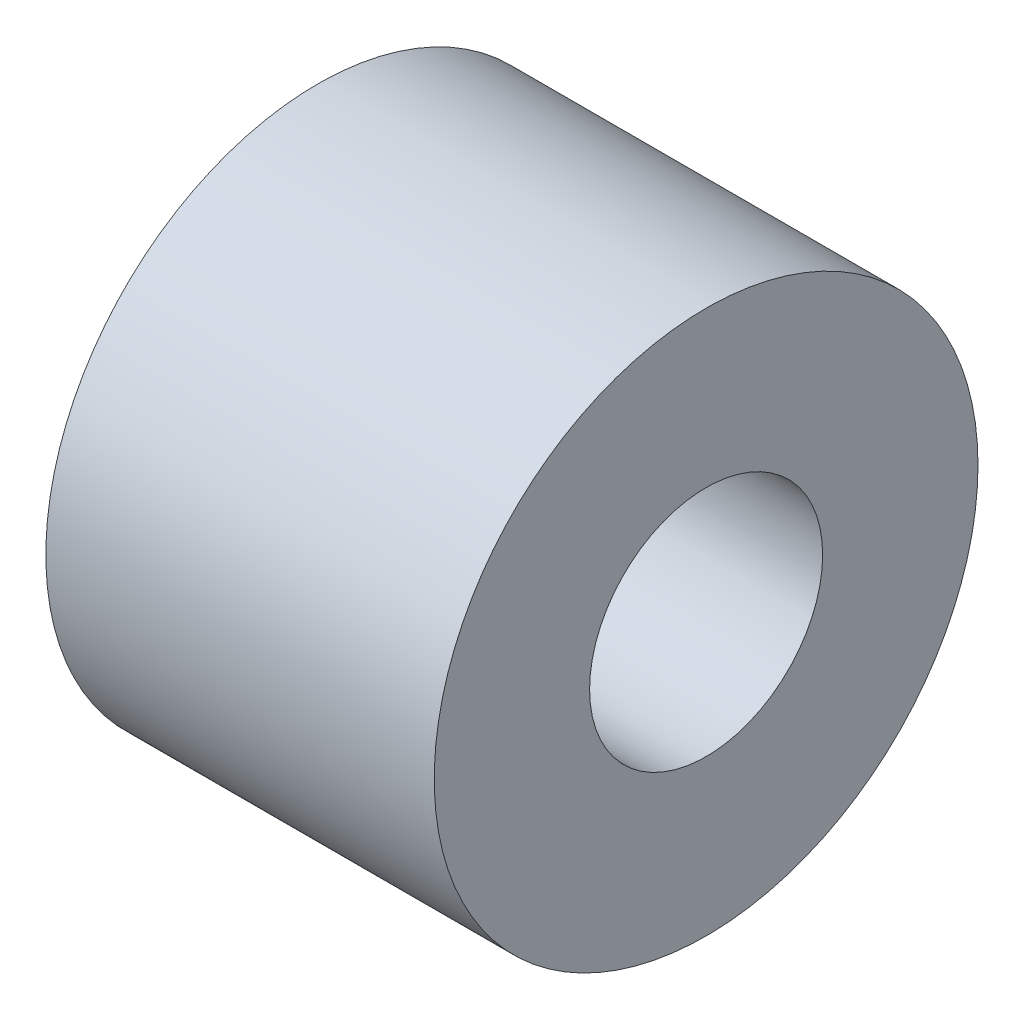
from build123d import *

# Parameters (mm, degrees)
SKETCH1_R           = 3.5
BOSS_EXTRUDE1_DEPTH = 5
SKETCH2_R           = 1.5
CUT_EXTRUDE1_DEPTH  = 4


with BuildPart() as part:
    # Sketch1 → Boss-Extrude1 (new body)
    with BuildSketch(Plane(origin=(0, 0, 0), x_dir=(0, 0, -1), z_dir=(1, 0, 0))):
        Circle(SKETCH1_R)
    extrude(amount=BOSS_EXTRUDE1_DEPTH)

    # Sketch2 → Cut-Extrude1 (cut)
    with BuildSketch(Plane(origin=(5, 0, 0), x_dir=(0, 0, -1), z_dir=(1, 0, 0))):
        Circle(SKETCH2_R)
    extrude(amount=-CUT_EXTRUDE1_DEPTH, mode=Mode.SUBTRACT)


solid = part.part
